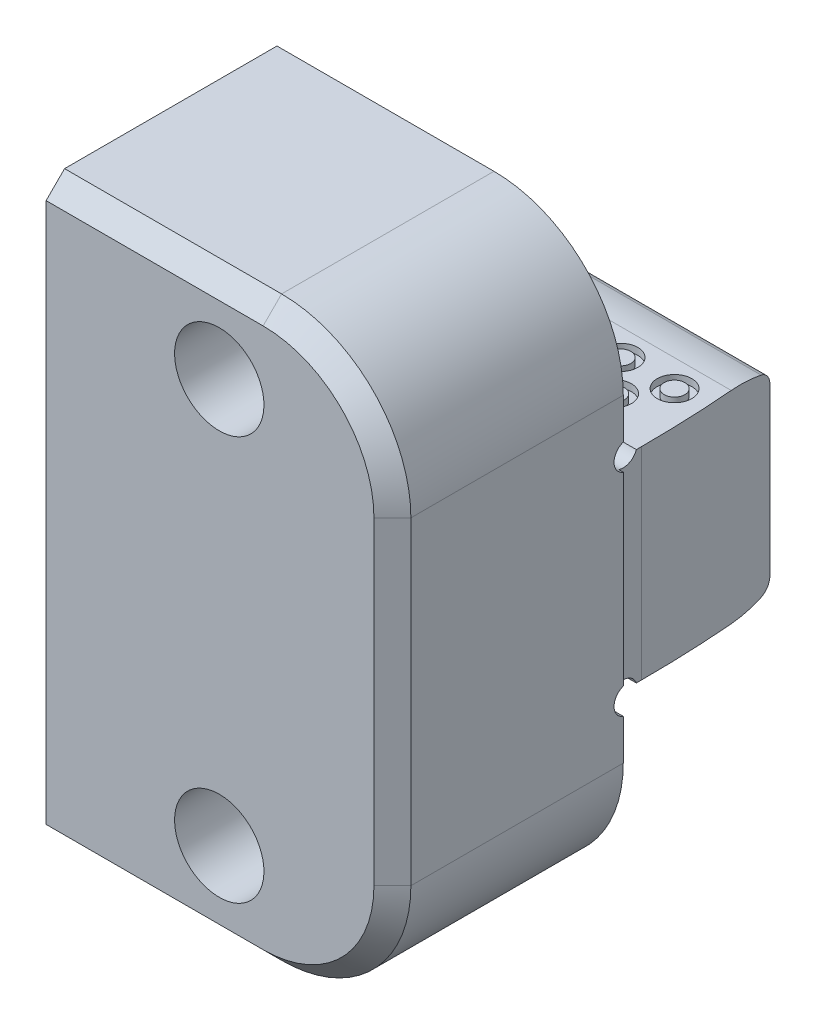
from build123d import *

# Parameters (mm, degrees)
EXTRUDE1_DEPTH        = 9.525
SKETCH7_W             = 21.968267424
SKETCH7_H             = 31.720833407
CUT_EXTRUDE3_DEPTH    = 0.254
SKETCH8_R             = 0.762
CUT_EXTRUDE4_DEPTH    = 28.86051193
CUT_EXTRUDE5_DEPTH    = 28.86051193
CUT_EXTRUDE6_DEPTH    = 36.497579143
SKETCH15_R            = 0.9525
SKETCH15_R_2          = 0.5715
CUT_EXTRUDE7_DEPTH    = 0.381
F_8_CBORE_D           = 4.9149
F_8_CBORE_CBORE_D     = 7.9375
F_8_CBORE_CBORE_DEPTH = 4.95935
FILLET1_R             = 7.112
CHAMFER1_SIZE         = 1.016


with BuildPart() as part:
    # Sketch3 → Extrude1 (new, symmetric)
    with BuildSketch(Plane(origin=(0, 0, 0), x_dir=(0, 0, -1), z_dir=(1, 0, 0))):
        Polygon((-12.7, -15.875), (0, -15.875), (0, -5.56006), (8.763, -5.56006), (8.763, 5.56006), (0, 5.56006), (0, 15.875), (-12.7, 15.875), align=None)
    extrude(amount=EXTRUDE1_DEPTH, both=True)

    # Sketch7 → Cut-Extrude3 (cut)
    with BuildSketch(Plane(origin=(9.525, 0, 0), x_dir=(0, 0, -1), z_dir=(1, 0, 0))):
        with Locations((10.984133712, 1.307835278)):
            Rectangle(SKETCH7_W, SKETCH7_H)
    extrude(amount=-CUT_EXTRUDE3_DEPTH, mode=Mode.SUBTRACT)

    # Sketch8 → Cut-Extrude4 (cut, through all)
    with BuildSketch(Plane(origin=(9.525, 0, 0), x_dir=(0, 0, -1), z_dir=(1, 0, 0))):
        with Locations((0.254, 5.81406)):
            Circle(SKETCH8_R)
        with Locations((0.254, -5.81406)):
            Circle(SKETCH8_R)
    extrude(amount=-CUT_EXTRUDE4_DEPTH, mode=Mode.SUBTRACT)

    # Sketch9 → Cut-Extrude5 (cut, through all)
    with BuildSketch(Plane(origin=(9.525, 0, 0), x_dir=(0, 0, -1), z_dir=(1, 0, 0))):
        with BuildLine():
            Line((8.763, 4.564040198), (12.7508, 4.564040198))
            Line((12.7508, 4.564040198), (12.7508, 10.914040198))
            Line((12.7508, 10.914040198), (6.4008, 10.914040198))
            Line((6.4008, 10.914040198), (6.4008, 5.56006))
            ThreePointArc((6.4008, 5.56006), (7.31967584, 5.49322538), (8.219209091, 5.294128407))
            ThreePointArc((8.219209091, 5.294128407), (8.612113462, 5.019215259), (8.763, 4.564040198))
        make_face()
        with BuildLine():
            Line((12.7508, -4.564040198), (12.7508, -10.914040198))
            Line((12.7508, -10.914040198), (6.4008, -10.914040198))
            Line((6.4008, -10.914040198), (6.4008, -5.56006))
            ThreePointArc((6.4008, -5.56006), (7.31967584, -5.49322538), (8.219209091, -5.294128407))
            ThreePointArc((8.219209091, -5.294128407), (8.612113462, -5.019215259), (8.763, -4.564040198))
            Line((8.763, -4.564040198), (12.7508, -4.564040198))
        make_face()
    extrude(amount=-CUT_EXTRUDE5_DEPTH, mode=Mode.SUBTRACT)

    # Sketch13 → Cut-Extrude6 (cut, through all)
    with BuildSketch(Plane(origin=(0, 15.875, 0), x_dir=(1, 0, 0), z_dir=(0, 1, 0))):
        with BuildLine():
            Line((7.988039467, 13.97), (20.688039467, 13.97))
            Line((20.688039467, 13.97), (20.688039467, 1.27))
            Line((20.688039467, 1.27), (9.271, 1.27))
            ThreePointArc((9.271, 1.27), (8.949445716, 7.652319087), (7.988039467, 13.97))
        make_face()
    extrude(amount=-CUT_EXTRUDE6_DEPTH, mode=Mode.SUBTRACT)

    # Sketch15 → Cut-Extrude7 (cut)
    # profile 1 of 11: a face of its own
    with BuildSketch(Plane(origin=(0, 5.56006, 0), x_dir=(1, 0, 0), z_dir=(0, 1, 0))):
        with Locations(Location((-4.4704, 4.9276, 0), (0, 0, 270))):
            Circle(SKETCH15_R)
        with Locations(Location((-4.4704, 4.9276, 0), (0, 0, 270))):
            Circle(SKETCH15_R_2, mode=Mode.SUBTRACT)
    # profile 2 of 11: a face of its own
    with BuildSketch(Plane(origin=(0, 5.56006, 0), x_dir=(1, 0, 0), z_dir=(0, 1, 0))):
        with Locations(Location((-1.4986, 4.9276, 0), (0, 0, 270))):
            Circle(SKETCH15_R)
        with Locations(Location((-1.4986, 4.9276, 0), (0, 0, 270))):
            Circle(SKETCH15_R_2, mode=Mode.SUBTRACT)
    # profile 3 of 11: a face of its own
    with BuildSketch(Plane(origin=(0, 5.56006, 0), x_dir=(1, 0, 0), z_dir=(0, 1, 0))):
        with Locations(Location((-7.4422, 4.9276, 0), (0, 0, 270))):
            Circle(SKETCH15_R)
        with Locations(Location((-7.4422, 4.9276, 0), (0, 0, 270))):
            Circle(SKETCH15_R_2, mode=Mode.SUBTRACT)
    # profile 4 of 11: a face of its own
    with BuildSketch(Plane(origin=(0, 5.56006, 0), x_dir=(1, 0, 0), z_dir=(0, 1, 0))):
        with Locations(Location((1.4732, 4.9276, 0), (0, 0, 270))):
            Circle(SKETCH15_R)
        with Locations(Location((1.4732, 4.9276, 0), (0, 0, 270))):
            Circle(SKETCH15_R_2, mode=Mode.SUBTRACT)
    # profile 5 of 11: a face of its own
    with BuildSketch(Plane(origin=(0, 5.56006, 0), x_dir=(1, 0, 0), z_dir=(0, 1, 0))):
        with Locations(Location((7.4168, 4.9276, 0), (0, 0, 270))):
            Circle(SKETCH15_R)
        with Locations(Location((7.4168, 4.9276, 0), (0, 0, 270))):
            Circle(SKETCH15_R_2, mode=Mode.SUBTRACT)
    # profile 6 of 11: a face of its own
    with BuildSketch(Plane(origin=(0, 5.56006, 0), x_dir=(1, 0, 0), z_dir=(0, 1, 0))):
        with Locations(Location((4.445, 4.9276, 0), (0, 0, 270))):
            Circle(SKETCH15_R)
        with Locations(Location((4.445, 4.9276, 0), (0, 0, 270))):
            Circle(SKETCH15_R_2, mode=Mode.SUBTRACT)
    # profile 7 of 11: a face of its own
    with BuildSketch(Plane(origin=(0, 5.56006, 0), x_dir=(1, 0, 0), z_dir=(0, 1, 0))):
        with Locations(Location((-2.921, 3.0226, 0), (0, 0, 270))):
            Circle(SKETCH15_R)
        with Locations(Location((-2.921, 3.0226, 0), (0, 0, 270))):
            Circle(SKETCH15_R_2, mode=Mode.SUBTRACT)
    # profile 8 of 11: a face of its own
    with BuildSketch(Plane(origin=(0, 5.56006, 0), x_dir=(1, 0, 0), z_dir=(0, 1, 0))):
        with Locations(Location((0.0508, 3.0226, 0), (0, 0, 270))):
            Circle(SKETCH15_R)
        with Locations(Location((0.0508, 3.0226, 0), (0, 0, 270))):
            Circle(SKETCH15_R_2, mode=Mode.SUBTRACT)
    # profile 9 of 11: a face of its own
    with BuildSketch(Plane(origin=(0, 5.56006, 0), x_dir=(1, 0, 0), z_dir=(0, 1, 0))):
        with Locations(Location((-5.8928, 3.0226, 0), (0, 0, 270))):
            Circle(SKETCH15_R)
        with Locations(Location((-5.8928, 3.0226, 0), (0, 0, 270))):
            Circle(SKETCH15_R_2, mode=Mode.SUBTRACT)
    # profile 10 of 11: a face of its own
    with BuildSketch(Plane(origin=(0, 5.56006, 0), x_dir=(1, 0, 0), z_dir=(0, 1, 0))):
        with Locations(Location((3.0226, 3.0226, 0), (0, 0, 270))):
            Circle(SKETCH15_R)
        with Locations(Location((3.0226, 3.0226, 0), (0, 0, 270))):
            Circle(SKETCH15_R_2, mode=Mode.SUBTRACT)
    # profile 11 of 11: a face of its own
    with BuildSketch(Plane(origin=(0, 5.56006, 0), x_dir=(1, 0, 0), z_dir=(0, 1, 0))):
        with Locations(Location((5.9944, 3.0226, 0), (0, 0, 270))):
            Circle(SKETCH15_R)
        with Locations(Location((5.9944, 3.0226, 0), (0, 0, 270))):
            Circle(SKETCH15_R_2, mode=Mode.SUBTRACT)
    cut_extrude7 = extrude(amount=-CUT_EXTRUDE7_DEPTH, mode=Mode.SUBTRACT)

    # Mirror1: Cut-Extrude7 across plane
    add(cut_extrude7.mirror(Plane.ZX), mode=Mode.SUBTRACT)

    # 8 CBORE (through all)
    with Locations(Plane(origin=(0, 0, 0), x_dir=(-1, 0, 0), z_dir=(0, 0, -1))):
        with Locations((0, 11.1125), (0, -11.1125)):
            CounterBoreHole(F_8_CBORE_D / 2, F_8_CBORE_CBORE_D / 2, F_8_CBORE_CBORE_DEPTH)

    # Fillet1
    fillet1_edges = [part.edges().sort_by_distance(p)[0] for p in [
        (9.525, 15.875, 6.35),
        (9.525, -15.875, 6.35),
    ]]
    fillet(fillet1_edges, radius=FILLET1_R)

    # Chamfer1
    chamfer1_edges = [part.edges().sort_by_distance(p)[0] for p in [
        (9.525, 0, 12.7),
        (-3.556, -15.875, 12.7),
        (-3.556, 15.875, 12.7),
        (7.441943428, 13.791943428, 12.7),
        (7.441943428, -13.791943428, 12.7),
    ]]
    chamfer(chamfer1_edges, length=CHAMFER1_SIZE)


solid = part.part
